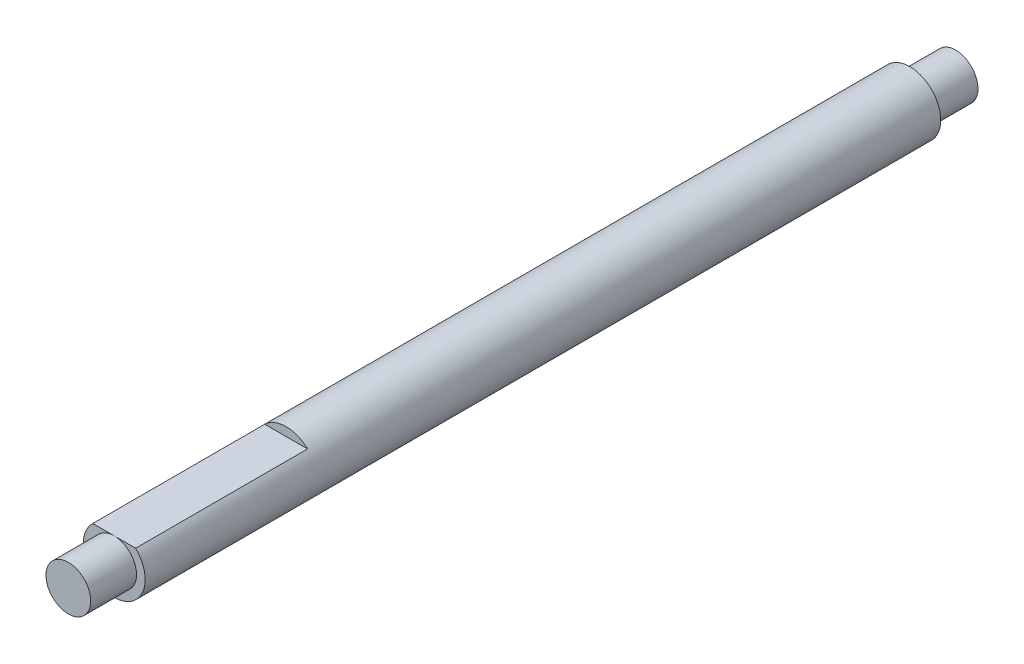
from build123d import *

# Parameters (mm, degrees)
ESBO_O1_R                = 2.7
RESSALTO_EXTRUS_O1_DEPTH = 69.4
ESBO_O2_R                = 1.95
RESSALTO_EXTRUS_O2_DEPTH = 4
RESSALTO_EXTRUS_O3_START = 4
ESBO_O3_R                = 1.95
RESSALTO_EXTRUS_O3_DEPTH = 4
ESBO_O5_W                = 3.73496988
ESBO_O5_H                = 0.75
CORTE_EXTRUS_O2_DEPTH    = 15


with BuildPart() as part:
    # Esbo_o1 → Ressalto-extrus_o1 (new body)
    with BuildSketch(Plane.XY):
        Circle(ESBO_O1_R)
    extrude(amount=RESSALTO_EXTRUS_O1_DEPTH)

    # Esbo_o2 → Ressalto-extrus_o2 (add)
    with BuildSketch(Plane.XY.offset(69.4)):
        Circle(ESBO_O2_R)
    extrude(amount=RESSALTO_EXTRUS_O2_DEPTH)

    # Esbo_o3 → Ressalto-extrus_o3 (add)
    with BuildSketch(Plane(origin=(0, 0, 0), x_dir=(-1, 0, 0), z_dir=(0, 0, -1)).offset(RESSALTO_EXTRUS_O3_START)):
        with Locations(Location((0, 0, 0), (0, 0, 180))):
            Circle(ESBO_O3_R)
    extrude(amount=-RESSALTO_EXTRUS_O3_DEPTH)

    # Esbo_o5 → Corte-extrus_o2 (cut)
    with BuildSketch(Plane.XY.offset(69.4)):
        with Locations((0, 2.325)):
            Rectangle(ESBO_O5_W, ESBO_O5_H)
    extrude(amount=-CORTE_EXTRUS_O2_DEPTH, mode=Mode.SUBTRACT)


solid = part.part
